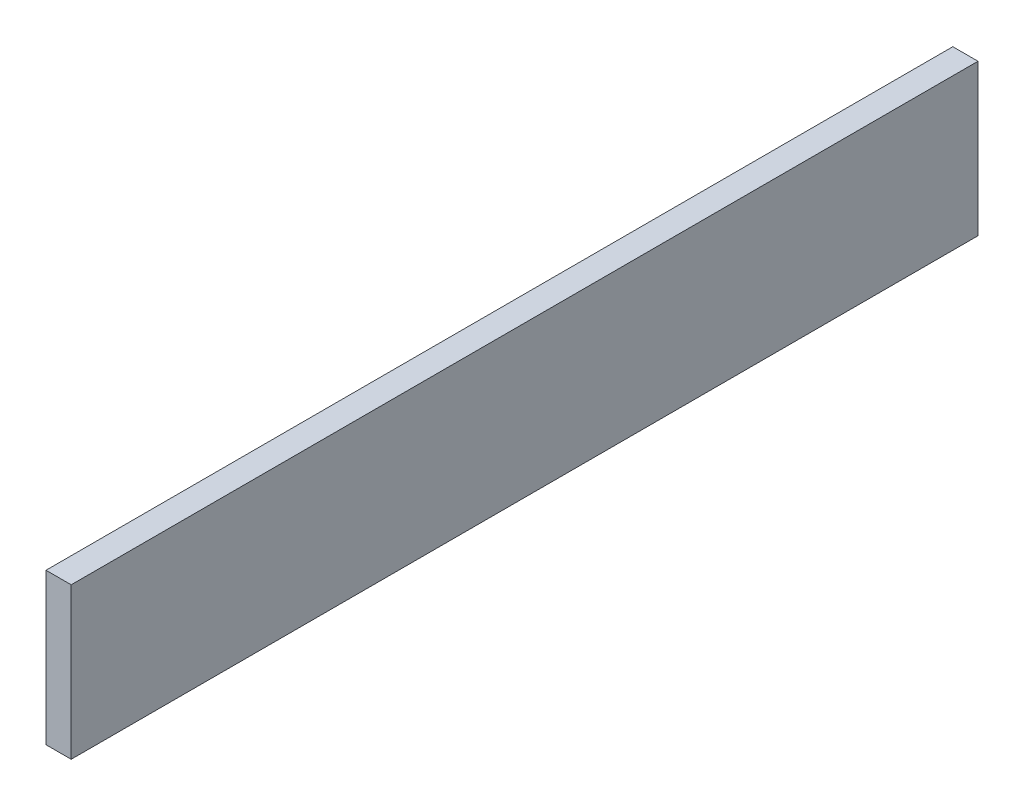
from build123d import *

# Parameters (mm, degrees)
SKETCH1_W           = 3.175
SKETCH1_H           = 19.05
BOSS_EXTRUDE1_DEPTH = 57.15


with BuildPart() as part:
    # Sketch1 → Boss-Extrude1 (new, symmetric)
    with BuildSketch(Plane.XY):
        with Locations((1.5875, -9.525)):
            Rectangle(SKETCH1_W, SKETCH1_H)
    extrude(amount=BOSS_EXTRUDE1_DEPTH, both=True)


solid = part.part
